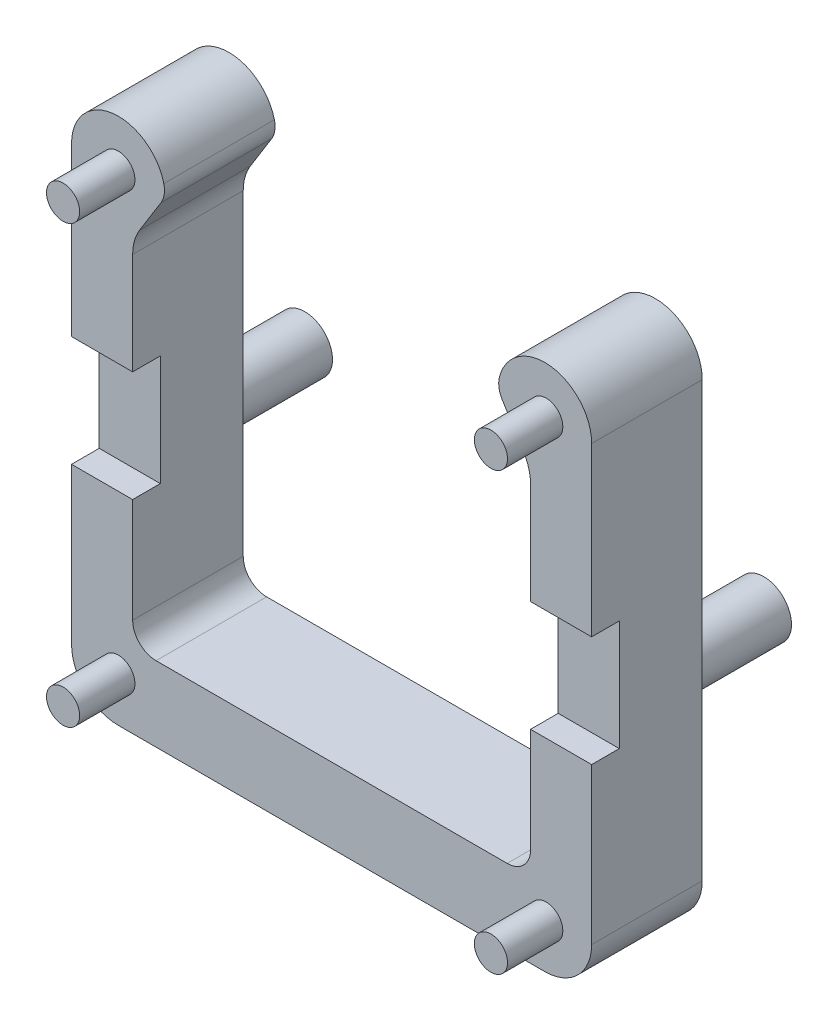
from build123d import *

# Parameters (mm, degrees)
BOSS_EXTRU_1_DEPTH      = 6
ESQUISSE1_R             = 0.9
BOSS_EXTRU_2_DEPTH      = 3
ESQUISSE3_R             = 1.5
BOSS_EXTRU_3_DEPTH      = 5
ESQUISSE4_W             = 1.5
ESQUISSE4_H             = 6
ENL_V_MAT_EXTRU_1_DEPTH = 40.972534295


with BuildPart() as part:
    # Esquisse2 → Boss.-Extru.1 (new body)
    with BuildSketch(Plane.XY):
        with BuildLine():
            Line((-2.54, 0), (-2.54, -23.5458))
            ThreePointArc((-2.54, -23.5458), (-1.796051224, -25.341851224), (0, -26.0858))
            Line((0, -26.0858), (23.1394, -26.0858))
            ThreePointArc((23.1394, -26.0858), (24.935451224, -25.341851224), (25.6794, -23.5458))
            Line((25.6794, -23.5458), (25.6794, 0))
            ThreePointArc((25.6794, 0), (23.444552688, 2.521603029), (20.672721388, 0.605884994))
            ThreePointArc((20.672721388, 0.605884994), (20.651732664, 0.104042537), (20.826943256, -0.366688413))
            Line((20.826943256, -0.366688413), (21.982934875, -2.229581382))
            ThreePointArc((21.982934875, -2.229581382), (22.267394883, -2.872537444), (22.3647, -3.568843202))
            Line((22.3647, -3.568843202), (22.3647, -20.7518))
            ThreePointArc((22.3647, -20.7518), (21.992725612, -21.649825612), (21.0947, -22.0218))
            Line((21.0947, -22.0218), (2.0447, -22.0218))
            ThreePointArc((2.0447, -22.0218), (1.146674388, -21.649825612), (0.7747, -20.7518))
            Line((0.7747, -20.7518), (0.7747, -3.568843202))
            ThreePointArc((0.7747, -3.568843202), (0.872005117, -2.872537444), (1.156465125, -2.229581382))
            Line((1.156465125, -2.229581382), (2.312456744, -0.366688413))
            ThreePointArc((2.312456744, -0.366688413), (2.487667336, 0.104042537), (2.466678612, 0.605884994))
            ThreePointArc((2.466678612, 0.605884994), (-0.305152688, 2.521603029), (-2.54, 0))
        make_face()
    extrude(amount=-BOSS_EXTRU_1_DEPTH)

    # Esquisse1 → Boss.-Extru.2 (add)
    with BuildSketch(Plane.XY):
        Circle(ESQUISSE1_R)
        with Locations((23.215, 0)):
            Circle(ESQUISSE1_R)
        with Locations((0, -23.68)):
            Circle(ESQUISSE1_R)
        with Locations((23.215, -23.68)):
            Circle(ESQUISSE1_R)
    extrude(amount=BOSS_EXTRU_2_DEPTH)

    # Esquisse3 → Boss.-Extru.3 (add)
    with BuildSketch(Plane(origin=(0, 0, -6), x_dir=(-1, 0, 0), z_dir=(0, 0, -1))):
        with Locations(Location((-24.02205, -14.0858, 0), (0, 0, 180))):
            Circle(ESQUISSE3_R)
        with Locations(Location((0.88265, -14.0858, 0), (0, 0, 180))):
            Circle(ESQUISSE3_R)
    extrude(amount=BOSS_EXTRU_3_DEPTH)

    # Esquisse4 → Enl_v. mat.-Extru.1 (cut, through all)
    with BuildSketch(Plane.ZY.offset(2.54)):
        with Locations((-0.75, -12.0858)):
            Rectangle(ESQUISSE4_W, ESQUISSE4_H)
    extrude(amount=-ENL_V_MAT_EXTRU_1_DEPTH, mode=Mode.SUBTRACT)


solid = part.part
